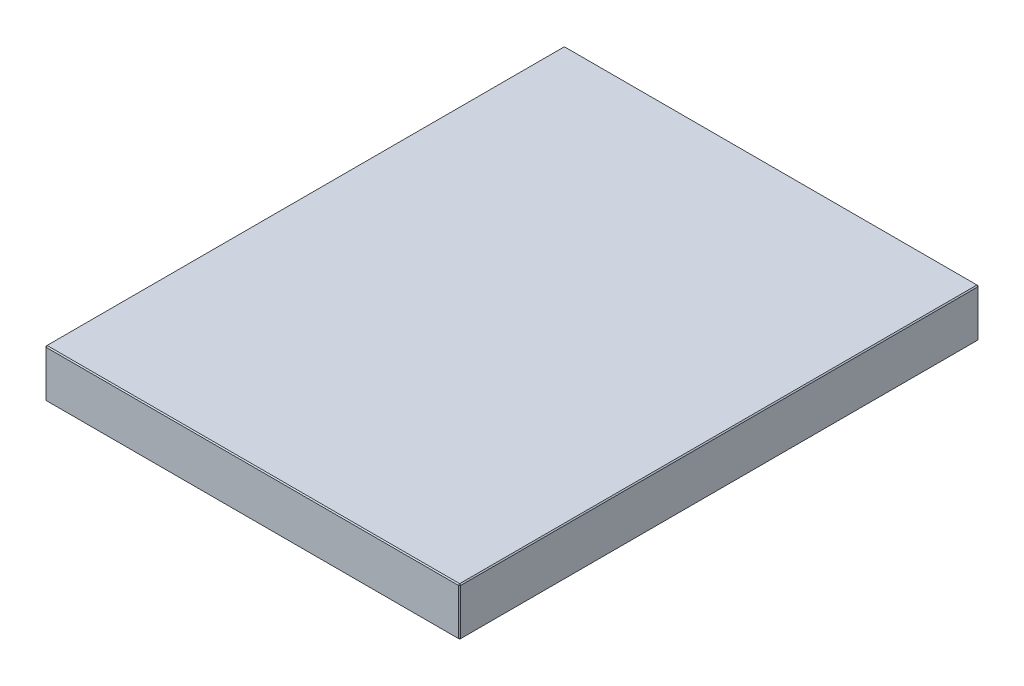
ISO-10303-21;
HEADER;
FILE_DESCRIPTION(('STEP AP214'),'2;1');
FILE_NAME('part.step','',(''),(''),'','','');
FILE_SCHEMA(('AUTOMOTIVE_DESIGN { 1 0 10303 214 1 1 1 1 }'));
ENDSEC;
DATA;
#1=APPLICATION_CONTEXT('core data for automotive mechanical design processes');
#2=APPLICATION_PROTOCOL_DEFINITION('international standard','automotive_design',2000,#1);
#3=PRODUCT_CONTEXT('',#1,'mechanical');
#4=PRODUCT('Part','Part','',(#3));
#5=PRODUCT_RELATED_PRODUCT_CATEGORY('part','',(#4));
#6=PRODUCT_DEFINITION_FORMATION('','',#4);
#7=PRODUCT_DEFINITION_CONTEXT('part definition',#1,'design');
#8=PRODUCT_DEFINITION('design','',#6,#7);
#9=PRODUCT_DEFINITION_SHAPE('','',#8);
#10=(LENGTH_UNIT() NAMED_UNIT(*) SI_UNIT(.MILLI.,.METRE.));
#11=(NAMED_UNIT(*) PLANE_ANGLE_UNIT() SI_UNIT($,.RADIAN.));
#12=(NAMED_UNIT(*) SI_UNIT($,.STERADIAN.) SOLID_ANGLE_UNIT());
#13=UNCERTAINTY_MEASURE_WITH_UNIT(LENGTH_MEASURE(1.E-05),#10,'distance_accuracy_value','');
#14=(GEOMETRIC_REPRESENTATION_CONTEXT(3) GLOBAL_UNCERTAINTY_ASSIGNED_CONTEXT((#13)) GLOBAL_UNIT_ASSIGNED_CONTEXT((#10,
#11,#12)) REPRESENTATION_CONTEXT('',''));
#15=CARTESIAN_POINT('',(0.,0.,0.));
#16=DIRECTION('',(0.,0.,1.));
#17=DIRECTION('',(1.,0.,0.));
#18=AXIS2_PLACEMENT_3D('',#15,#16,#17);
#19=CARTESIAN_POINT('',(-198.,46.,248.));
#20=DIRECTION('',(1.,0.,0.));
#21=DIRECTION('',(0.,0.,-1.));
#22=AXIS2_PLACEMENT_3D('',#19,#20,#21);
#23=PLANE('',#22);
#24=DIRECTION('',(0.,-1.,0.));
#25=VECTOR('',#24,1.);
#26=CARTESIAN_POINT('',(-198.,46.,-247.));
#27=LINE('',#26,#25);
#28=CARTESIAN_POINT('',(-198.,45.,-247.));
#29=VERTEX_POINT('',#28);
#30=CARTESIAN_POINT('',(-198.,1.,-247.));
#31=VERTEX_POINT('',#30);
#32=EDGE_CURVE('E114',#29,#31,#27,.T.);
#33=ORIENTED_EDGE('',*,*,#32,.T.);
#34=DIRECTION('',(0.,0.,1.));
#35=VECTOR('',#34,1.);
#36=CARTESIAN_POINT('',(-198.,1.,248.));
#37=LINE('',#36,#35);
#38=CARTESIAN_POINT('',(-198.,1.,247.));
#39=VERTEX_POINT('',#38);
#40=EDGE_CURVE('E110',#31,#39,#37,.T.);
#41=ORIENTED_EDGE('',*,*,#40,.T.);
#42=DIRECTION('',(0.,1.,0.));
#43=VECTOR('',#42,1.);
#44=CARTESIAN_POINT('',(-198.,46.,247.));
#45=LINE('',#44,#43);
#46=CARTESIAN_POINT('',(-198.,45.,247.));
#47=VERTEX_POINT('',#46);
#48=EDGE_CURVE('E103',#39,#47,#45,.T.);
#49=ORIENTED_EDGE('',*,*,#48,.T.);
#50=DIRECTION('',(0.,0.,-1.));
#51=VECTOR('',#50,1.);
#52=CARTESIAN_POINT('',(-198.,45.,-248.));
#53=LINE('',#52,#51);
#54=EDGE_CURVE('E107',#47,#29,#53,.T.);
#55=ORIENTED_EDGE('',*,*,#54,.T.);
#56=EDGE_LOOP('',(#33,#41,#49,#55));
#57=FACE_BOUND('',#56,.T.);
#58=ADVANCED_FACE('F15',(#57),#23,.F.);
#59=CARTESIAN_POINT('',(198.,46.,248.));
#60=DIRECTION('',(0.,0.,-1.));
#61=DIRECTION('',(-1.,0.,0.));
#62=AXIS2_PLACEMENT_3D('',#59,#60,#61);
#63=PLANE('',#62);
#64=DIRECTION('',(-1.,0.,0.));
#65=VECTOR('',#64,1.);
#66=CARTESIAN_POINT('',(-198.,45.,248.));
#67=LINE('',#66,#65);
#68=CARTESIAN_POINT('',(197.,45.,248.));
#69=VERTEX_POINT('',#68);
#70=CARTESIAN_POINT('',(-197.,45.,248.));
#71=VERTEX_POINT('',#70);
#72=EDGE_CURVE('E164',#69,#71,#67,.T.);
#73=ORIENTED_EDGE('',*,*,#72,.T.);
#74=DIRECTION('',(0.,-1.,0.));
#75=VECTOR('',#74,1.);
#76=CARTESIAN_POINT('',(-197.,46.,248.));
#77=LINE('',#76,#75);
#78=CARTESIAN_POINT('',(-197.,1.,248.));
#79=VERTEX_POINT('',#78);
#80=EDGE_CURVE('E122',#71,#79,#77,.T.);
#81=ORIENTED_EDGE('',*,*,#80,.T.);
#82=DIRECTION('',(1.,0.,0.));
#83=VECTOR('',#82,1.);
#84=CARTESIAN_POINT('',(198.,1.,248.));
#85=LINE('',#84,#83);
#86=CARTESIAN_POINT('',(197.,1.,248.));
#87=VERTEX_POINT('',#86);
#88=EDGE_CURVE('E168',#79,#87,#85,.T.);
#89=ORIENTED_EDGE('',*,*,#88,.T.);
#90=DIRECTION('',(0.,1.,0.));
#91=VECTOR('',#90,1.);
#92=CARTESIAN_POINT('',(197.,46.,248.));
#93=LINE('',#92,#91);
#94=EDGE_CURVE('E166',#87,#69,#93,.T.);
#95=ORIENTED_EDGE('',*,*,#94,.T.);
#96=EDGE_LOOP('',(#73,#81,#89,#95));
#97=FACE_BOUND('',#96,.T.);
#98=ADVANCED_FACE('F275',(#97),#63,.F.);
#99=CARTESIAN_POINT('',(198.,46.,248.));
#100=DIRECTION('',(-1.,0.,0.));
#101=DIRECTION('',(0.,0.,1.));
#102=AXIS2_PLACEMENT_3D('',#99,#100,#101);
#103=PLANE('',#102);
#104=DIRECTION('',(0.,0.,-1.));
#105=VECTOR('',#104,1.);
#106=CARTESIAN_POINT('',(198.,1.,248.));
#107=LINE('',#106,#105);
#108=CARTESIAN_POINT('',(198.,1.,247.));
#109=VERTEX_POINT('',#108);
#110=CARTESIAN_POINT('',(198.,1.,-247.));
#111=VERTEX_POINT('',#110);
#112=EDGE_CURVE('E159',#109,#111,#107,.T.);
#113=ORIENTED_EDGE('',*,*,#112,.T.);
#114=DIRECTION('',(0.,1.,0.));
#115=VECTOR('',#114,1.);
#116=CARTESIAN_POINT('',(198.,46.,-247.));
#117=LINE('',#116,#115);
#118=CARTESIAN_POINT('',(198.,45.,-247.));
#119=VERTEX_POINT('',#118);
#120=EDGE_CURVE('E161',#111,#119,#117,.T.);
#121=ORIENTED_EDGE('',*,*,#120,.T.);
#122=DIRECTION('',(0.,0.,1.));
#123=VECTOR('',#122,1.);
#124=CARTESIAN_POINT('',(198.,45.,248.));
#125=LINE('',#124,#123);
#126=CARTESIAN_POINT('',(198.,45.,247.));
#127=VERTEX_POINT('',#126);
#128=EDGE_CURVE('E155',#119,#127,#125,.T.);
#129=ORIENTED_EDGE('',*,*,#128,.T.);
#130=DIRECTION('',(0.,-1.,0.));
#131=VECTOR('',#130,1.);
#132=CARTESIAN_POINT('',(198.,46.,247.));
#133=LINE('',#132,#131);
#134=EDGE_CURVE('E157',#127,#109,#133,.T.);
#135=ORIENTED_EDGE('',*,*,#134,.T.);
#136=EDGE_LOOP('',(#113,#121,#129,#135));
#137=FACE_BOUND('',#136,.T.);
#138=ADVANCED_FACE('F254',(#137),#103,.F.);
#139=CARTESIAN_POINT('',(198.,46.,-248.));
#140=DIRECTION('',(0.,0.,1.));
#141=DIRECTION('',(1.,0.,0.));
#142=AXIS2_PLACEMENT_3D('',#139,#140,#141);
#143=PLANE('',#142);
#144=DIRECTION('',(0.,-1.,0.));
#145=VECTOR('',#144,1.);
#146=CARTESIAN_POINT('',(197.,46.,-248.));
#147=LINE('',#146,#145);
#148=CARTESIAN_POINT('',(197.,45.,-248.));
#149=VERTEX_POINT('',#148);
#150=CARTESIAN_POINT('',(197.,1.,-248.));
#151=VERTEX_POINT('',#150);
#152=EDGE_CURVE('E148',#149,#151,#147,.T.);
#153=ORIENTED_EDGE('',*,*,#152,.T.);
#154=DIRECTION('',(-1.,0.,0.));
#155=VECTOR('',#154,1.);
#156=CARTESIAN_POINT('',(198.,1.,-248.));
#157=LINE('',#156,#155);
#158=CARTESIAN_POINT('',(-197.,1.,-248.));
#159=VERTEX_POINT('',#158);
#160=EDGE_CURVE('E153',#151,#159,#157,.T.);
#161=ORIENTED_EDGE('',*,*,#160,.T.);
#162=DIRECTION('',(0.,1.,0.));
#163=VECTOR('',#162,1.);
#164=CARTESIAN_POINT('',(-197.,46.,-248.));
#165=LINE('',#164,#163);
#166=CARTESIAN_POINT('',(-197.,45.,-248.));
#167=VERTEX_POINT('',#166);
#168=EDGE_CURVE('E150',#159,#167,#165,.T.);
#169=ORIENTED_EDGE('',*,*,#168,.T.);
#170=DIRECTION('',(1.,0.,0.));
#171=VECTOR('',#170,1.);
#172=CARTESIAN_POINT('',(198.,45.,-248.));
#173=LINE('',#172,#171);
#174=EDGE_CURVE('E146',#167,#149,#173,.T.);
#175=ORIENTED_EDGE('',*,*,#174,.T.);
#176=EDGE_LOOP('',(#153,#161,#169,#175));
#177=FACE_BOUND('',#176,.T.);
#178=ADVANCED_FACE('F284',(#177),#143,.F.);
#179=CARTESIAN_POINT('',(0.,46.,0.));
#180=DIRECTION('',(0.,1.,0.));
#181=DIRECTION('',(0.,0.,1.));
#182=AXIS2_PLACEMENT_3D('',#179,#180,#181);
#183=PLANE('',#182);
#184=DIRECTION('',(0.,0.,-1.));
#185=VECTOR('',#184,1.);
#186=CARTESIAN_POINT('',(197.,46.,-248.));
#187=LINE('',#186,#185);
#188=CARTESIAN_POINT('',(197.,46.,247.));
#189=VERTEX_POINT('',#188);
#190=CARTESIAN_POINT('',(197.,46.,-247.));
#191=VERTEX_POINT('',#190);
#192=EDGE_CURVE('E24',#189,#191,#187,.T.);
#193=ORIENTED_EDGE('',*,*,#192,.T.);
#194=DIRECTION('',(-1.,0.,0.));
#195=VECTOR('',#194,1.);
#196=CARTESIAN_POINT('',(-198.,46.,-247.));
#197=LINE('',#196,#195);
#198=CARTESIAN_POINT('',(-197.,46.,-247.));
#199=VERTEX_POINT('',#198);
#200=EDGE_CURVE('E9',#191,#199,#197,.T.);
#201=ORIENTED_EDGE('',*,*,#200,.T.);
#202=DIRECTION('',(0.,0.,1.));
#203=VECTOR('',#202,1.);
#204=CARTESIAN_POINT('',(-197.,46.,248.));
#205=LINE('',#204,#203);
#206=CARTESIAN_POINT('',(-197.,46.,247.));
#207=VERTEX_POINT('',#206);
#208=EDGE_CURVE('E180',#199,#207,#205,.T.);
#209=ORIENTED_EDGE('',*,*,#208,.T.);
#210=DIRECTION('',(1.,0.,0.));
#211=VECTOR('',#210,1.);
#212=CARTESIAN_POINT('',(198.,46.,247.));
#213=LINE('',#212,#211);
#214=EDGE_CURVE('E35',#207,#189,#213,.T.);
#215=ORIENTED_EDGE('',*,*,#214,.T.);
#216=EDGE_LOOP('',(#193,#201,#209,#215));
#217=FACE_BOUND('',#216,.T.);
#218=ADVANCED_FACE('F350',(#217),#183,.T.);
#219=CARTESIAN_POINT('',(0.,0.,0.));
#220=DIRECTION('',(0.,1.,0.));
#221=DIRECTION('',(0.,0.,1.));
#222=AXIS2_PLACEMENT_3D('',#219,#220,#221);
#223=PLANE('',#222);
#224=DIRECTION('',(0.,0.,1.));
#225=VECTOR('',#224,1.);
#226=CARTESIAN_POINT('',(197.,0.,0.));
#227=LINE('',#226,#225);
#228=CARTESIAN_POINT('',(197.,0.,-247.));
#229=VERTEX_POINT('',#228);
#230=CARTESIAN_POINT('',(197.,0.,247.));
#231=VERTEX_POINT('',#230);
#232=EDGE_CURVE('E171',#229,#231,#227,.T.);
#233=ORIENTED_EDGE('',*,*,#232,.T.);
#234=DIRECTION('',(-1.,0.,0.));
#235=VECTOR('',#234,1.);
#236=CARTESIAN_POINT('',(0.,0.,247.));
#237=LINE('',#236,#235);
#238=CARTESIAN_POINT('',(-197.,0.,247.));
#239=VERTEX_POINT('',#238);
#240=EDGE_CURVE('E177',#231,#239,#237,.T.);
#241=ORIENTED_EDGE('',*,*,#240,.T.);
#242=DIRECTION('',(0.,0.,-1.));
#243=VECTOR('',#242,1.);
#244=CARTESIAN_POINT('',(-197.,0.,0.));
#245=LINE('',#244,#243);
#246=CARTESIAN_POINT('',(-197.,0.,-247.));
#247=VERTEX_POINT('',#246);
#248=EDGE_CURVE('E175',#239,#247,#245,.T.);
#249=ORIENTED_EDGE('',*,*,#248,.T.);
#250=DIRECTION('',(1.,0.,0.));
#251=VECTOR('',#250,1.);
#252=CARTESIAN_POINT('',(0.,0.,-247.));
#253=LINE('',#252,#251);
#254=EDGE_CURVE('E173',#247,#229,#253,.T.);
#255=ORIENTED_EDGE('',*,*,#254,.T.);
#256=EDGE_LOOP('',(#233,#241,#249,#255));
#257=FACE_BOUND('',#256,.T.);
#258=ADVANCED_FACE('F246',(#257),#223,.F.);
#259=CARTESIAN_POINT('',(198.,46.,247.));
#260=DIRECTION('',(-0.707106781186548,0.,-0.707106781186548));
#261=DIRECTION('',(0.,-1.,0.));
#262=AXIS2_PLACEMENT_3D('',#259,#260,#261);
#263=PLANE('',#262);
#264=DIRECTION('',(-0.707106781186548,0.,0.707106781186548));
#265=VECTOR('',#264,1.);
#266=CARTESIAN_POINT('',(197.,45.,248.));
#267=LINE('',#266,#265);
#268=EDGE_CURVE('E19',#69,#127,#267,.F.);
#269=ORIENTED_EDGE('',*,*,#268,.F.);
#270=ORIENTED_EDGE('',*,*,#94,.F.);
#271=DIRECTION('',(0.707106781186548,0.,-0.707106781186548));
#272=VECTOR('',#271,1.);
#273=CARTESIAN_POINT('',(197.,1.,248.));
#274=LINE('',#273,#272);
#275=EDGE_CURVE('E142',#109,#87,#274,.F.);
#276=ORIENTED_EDGE('',*,*,#275,.F.);
#277=ORIENTED_EDGE('',*,*,#134,.F.);
#278=EDGE_LOOP('',(#269,#270,#276,#277));
#279=FACE_BOUND('',#278,.T.);
#280=ADVANCED_FACE('F17',(#279),#263,.F.);
#281=CARTESIAN_POINT('',(197.,45.,248.));
#282=DIRECTION('',(0.577350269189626,0.577350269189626,0.577350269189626));
#283=DIRECTION('',(0.707106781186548,0.,-0.707106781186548));
#284=AXIS2_PLACEMENT_3D('',#281,#282,#283);
#285=PLANE('',#284);
#286=DIRECTION('',(0.,-0.707106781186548,0.707106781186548));
#287=VECTOR('',#286,1.);
#288=CARTESIAN_POINT('',(197.,45.,248.));
#289=LINE('',#288,#287);
#290=EDGE_CURVE('E226',#69,#189,#289,.F.);
#291=ORIENTED_EDGE('',*,*,#290,.F.);
#292=ORIENTED_EDGE('',*,*,#268,.T.);
#293=DIRECTION('',(-0.707106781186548,0.707106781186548,0.));
#294=VECTOR('',#293,1.);
#295=CARTESIAN_POINT('',(197.5,45.5,247.));
#296=LINE('',#295,#294);
#297=EDGE_CURVE('E228',#189,#127,#296,.F.);
#298=ORIENTED_EDGE('',*,*,#297,.F.);
#299=EDGE_LOOP('',(#291,#292,#298));
#300=FACE_BOUND('',#299,.T.);
#301=ADVANCED_FACE('F270',(#300),#285,.T.);
#302=CARTESIAN_POINT('',(197.,1.,248.));
#303=DIRECTION('',(0.577350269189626,-0.577350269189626,0.577350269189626));
#304=DIRECTION('',(0.707106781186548,0.,-0.707106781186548));
#305=AXIS2_PLACEMENT_3D('',#302,#303,#304);
#306=PLANE('',#305);
#307=DIRECTION('',(-0.707106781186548,-0.707106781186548,0.));
#308=VECTOR('',#307,1.);
#309=CARTESIAN_POINT('',(197.5,0.5,247.));
#310=LINE('',#309,#308);
#311=EDGE_CURVE('E220',#109,#231,#310,.T.);
#312=ORIENTED_EDGE('',*,*,#311,.F.);
#313=ORIENTED_EDGE('',*,*,#275,.T.);
#314=DIRECTION('',(0.,0.707106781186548,0.707106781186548));
#315=VECTOR('',#314,1.);
#316=CARTESIAN_POINT('',(197.,1.,248.));
#317=LINE('',#316,#315);
#318=EDGE_CURVE('E223',#231,#87,#317,.T.);
#319=ORIENTED_EDGE('',*,*,#318,.F.);
#320=EDGE_LOOP('',(#312,#313,#319));
#321=FACE_BOUND('',#320,.T.);
#322=ADVANCED_FACE('F235',(#321),#306,.T.);
#323=CARTESIAN_POINT('',(197.,46.,0.));
#324=DIRECTION('',(0.707106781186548,0.707106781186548,0.));
#325=DIRECTION('',(0.,0.,1.));
#326=AXIS2_PLACEMENT_3D('',#323,#324,#325);
#327=PLANE('',#326);
#328=ORIENTED_EDGE('',*,*,#297,.T.);
#329=ORIENTED_EDGE('',*,*,#128,.F.);
#330=DIRECTION('',(0.707106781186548,-0.707106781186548,0.));
#331=VECTOR('',#330,1.);
#332=CARTESIAN_POINT('',(198.,45.,-247.));
#333=LINE('',#332,#331);
#334=EDGE_CURVE('E215',#191,#119,#333,.T.);
#335=ORIENTED_EDGE('',*,*,#334,.F.);
#336=ORIENTED_EDGE('',*,*,#192,.F.);
#337=EDGE_LOOP('',(#328,#329,#335,#336));
#338=FACE_BOUND('',#337,.T.);
#339=ADVANCED_FACE('F265',(#338),#327,.T.);
#340=CARTESIAN_POINT('',(0.,46.,247.));
#341=DIRECTION('',(0.,0.707106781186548,0.707106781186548));
#342=DIRECTION('',(-1.,0.,0.));
#343=AXIS2_PLACEMENT_3D('',#340,#341,#342);
#344=PLANE('',#343);
#345=ORIENTED_EDGE('',*,*,#290,.T.);
#346=ORIENTED_EDGE('',*,*,#214,.F.);
#347=DIRECTION('',(0.,0.707106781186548,-0.707106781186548));
#348=VECTOR('',#347,1.);
#349=CARTESIAN_POINT('',(-197.,45.5,247.5));
#350=LINE('',#349,#348);
#351=EDGE_CURVE('E126',#71,#207,#350,.T.);
#352=ORIENTED_EDGE('',*,*,#351,.F.);
#353=ORIENTED_EDGE('',*,*,#72,.F.);
#354=EDGE_LOOP('',(#345,#346,#352,#353));
#355=FACE_BOUND('',#354,.T.);
#356=ADVANCED_FACE('F273',(#355),#344,.T.);
#357=CARTESIAN_POINT('',(-197.,46.,248.));
#358=DIRECTION('',(0.707106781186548,0.,-0.707106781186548));
#359=DIRECTION('',(0.,-1.,0.));
#360=AXIS2_PLACEMENT_3D('',#357,#358,#359);
#361=PLANE('',#360);
#362=DIRECTION('',(0.707106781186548,0.,0.707106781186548));
#363=VECTOR('',#362,1.);
#364=CARTESIAN_POINT('',(-197.,1.,248.));
#365=LINE('',#364,#363);
#366=EDGE_CURVE('E127',#79,#39,#365,.F.);
#367=ORIENTED_EDGE('',*,*,#366,.F.);
#368=ORIENTED_EDGE('',*,*,#80,.F.);
#369=DIRECTION('',(-0.707106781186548,0.,-0.707106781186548));
#370=VECTOR('',#369,1.);
#371=CARTESIAN_POINT('',(-198.,45.,247.));
#372=LINE('',#371,#370);
#373=EDGE_CURVE('E118',#47,#71,#372,.F.);
#374=ORIENTED_EDGE('',*,*,#373,.F.);
#375=ORIENTED_EDGE('',*,*,#48,.F.);
#376=EDGE_LOOP('',(#367,#368,#374,#375));
#377=FACE_BOUND('',#376,.T.);
#378=ADVANCED_FACE('F120',(#377),#361,.F.);
#379=CARTESIAN_POINT('',(198.,1.,248.));
#380=DIRECTION('',(0.,0.707106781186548,-0.707106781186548));
#381=DIRECTION('',(1.,0.,0.));
#382=AXIS2_PLACEMENT_3D('',#379,#380,#381);
#383=PLANE('',#382);
#384=ORIENTED_EDGE('',*,*,#318,.T.);
#385=ORIENTED_EDGE('',*,*,#88,.F.);
#386=DIRECTION('',(0.,-0.707106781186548,-0.707106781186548));
#387=VECTOR('',#386,1.);
#388=CARTESIAN_POINT('',(-197.,1.,248.));
#389=LINE('',#388,#387);
#390=EDGE_CURVE('E211',#239,#79,#389,.F.);
#391=ORIENTED_EDGE('',*,*,#390,.F.);
#392=ORIENTED_EDGE('',*,*,#240,.F.);
#393=EDGE_LOOP('',(#384,#385,#391,#392));
#394=FACE_BOUND('',#393,.T.);
#395=ADVANCED_FACE('F243',(#394),#383,.F.);
#396=CARTESIAN_POINT('',(198.,1.,248.));
#397=DIRECTION('',(-0.707106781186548,0.707106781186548,0.));
#398=DIRECTION('',(0.,0.,-1.));
#399=AXIS2_PLACEMENT_3D('',#396,#397,#398);
#400=PLANE('',#399);
#401=ORIENTED_EDGE('',*,*,#311,.T.);
#402=ORIENTED_EDGE('',*,*,#232,.F.);
#403=DIRECTION('',(0.707106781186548,0.707106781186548,0.));
#404=VECTOR('',#403,1.);
#405=CARTESIAN_POINT('',(197.5,0.500000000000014,-247.));
#406=LINE('',#405,#404);
#407=EDGE_CURVE('E208',#111,#229,#406,.F.);
#408=ORIENTED_EDGE('',*,*,#407,.F.);
#409=ORIENTED_EDGE('',*,*,#112,.F.);
#410=EDGE_LOOP('',(#401,#402,#408,#409));
#411=FACE_BOUND('',#410,.T.);
#412=ADVANCED_FACE('F251',(#411),#400,.F.);
#413=CARTESIAN_POINT('',(197.,46.,-248.));
#414=DIRECTION('',(-0.707106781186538,0.,0.707106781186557));
#415=DIRECTION('',(0.,-1.,0.));
#416=AXIS2_PLACEMENT_3D('',#413,#414,#415);
#417=PLANE('',#416);
#418=DIRECTION('',(0.707106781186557,0.,0.707106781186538));
#419=VECTOR('',#418,1.);
#420=CARTESIAN_POINT('',(198.,45.,-247.));
#421=LINE('',#420,#419);
#422=EDGE_CURVE('E217',#119,#149,#421,.F.);
#423=ORIENTED_EDGE('',*,*,#422,.F.);
#424=ORIENTED_EDGE('',*,*,#120,.F.);
#425=DIRECTION('',(-0.707106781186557,0.,-0.707106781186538));
#426=VECTOR('',#425,1.);
#427=CARTESIAN_POINT('',(197.,1.,-248.));
#428=LINE('',#427,#426);
#429=EDGE_CURVE('E205',#151,#111,#428,.F.);
#430=ORIENTED_EDGE('',*,*,#429,.F.);
#431=ORIENTED_EDGE('',*,*,#152,.F.);
#432=EDGE_LOOP('',(#423,#424,#430,#431));
#433=FACE_BOUND('',#432,.T.);
#434=ADVANCED_FACE('F258',(#433),#417,.F.);
#435=CARTESIAN_POINT('',(198.,45.,-247.));
#436=DIRECTION('',(0.577350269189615,0.577350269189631,-0.577350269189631));
#437=DIRECTION('',(0.,0.707106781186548,0.707106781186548));
#438=AXIS2_PLACEMENT_3D('',#435,#436,#437);
#439=PLANE('',#438);
#440=ORIENTED_EDGE('',*,*,#334,.T.);
#441=ORIENTED_EDGE('',*,*,#422,.T.);
#442=DIRECTION('',(0.,0.707106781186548,0.707106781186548));
#443=VECTOR('',#442,1.);
#444=CARTESIAN_POINT('',(197.,45.5,-247.5));
#445=LINE('',#444,#443);
#446=EDGE_CURVE('E134',#191,#149,#445,.F.);
#447=ORIENTED_EDGE('',*,*,#446,.F.);
#448=EDGE_LOOP('',(#440,#441,#447));
#449=FACE_BOUND('',#448,.T.);
#450=ADVANCED_FACE('F325',(#449),#439,.T.);
#451=CARTESIAN_POINT('',(-198.,45.,247.));
#452=DIRECTION('',(-0.577350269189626,0.577350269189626,0.577350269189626));
#453=DIRECTION('',(0.707106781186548,0.,0.707106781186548));
#454=AXIS2_PLACEMENT_3D('',#451,#452,#453);
#455=PLANE('',#454);
#456=ORIENTED_EDGE('',*,*,#373,.T.);
#457=ORIENTED_EDGE('',*,*,#351,.T.);
#458=DIRECTION('',(-0.707106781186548,-0.707106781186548,0.));
#459=VECTOR('',#458,1.);
#460=CARTESIAN_POINT('',(-198.,45.,247.));
#461=LINE('',#460,#459);
#462=EDGE_CURVE('E130',#47,#207,#461,.F.);
#463=ORIENTED_EDGE('',*,*,#462,.F.);
#464=EDGE_LOOP('',(#456,#457,#463));
#465=FACE_BOUND('',#464,.T.);
#466=ADVANCED_FACE('F131',(#465),#455,.T.);
#467=CARTESIAN_POINT('',(-197.,1.,248.));
#468=DIRECTION('',(-0.577350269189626,-0.577350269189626,0.577350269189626));
#469=DIRECTION('',(0.707106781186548,0.,0.707106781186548));
#470=AXIS2_PLACEMENT_3D('',#467,#468,#469);
#471=PLANE('',#470);
#472=ORIENTED_EDGE('',*,*,#390,.T.);
#473=ORIENTED_EDGE('',*,*,#366,.T.);
#474=DIRECTION('',(-0.707106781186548,0.707106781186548,0.));
#475=VECTOR('',#474,1.);
#476=CARTESIAN_POINT('',(-197.5,0.5,247.));
#477=LINE('',#476,#475);
#478=EDGE_CURVE('E135',#239,#39,#477,.T.);
#479=ORIENTED_EDGE('',*,*,#478,.F.);
#480=EDGE_LOOP('',(#472,#473,#479));
#481=FACE_BOUND('',#480,.T.);
#482=ADVANCED_FACE('F318',(#481),#471,.T.);
#483=CARTESIAN_POINT('',(197.,1.,-248.));
#484=DIRECTION('',(0.577350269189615,-0.577350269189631,-0.577350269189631));
#485=DIRECTION('',(0.,0.707106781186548,-0.707106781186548));
#486=AXIS2_PLACEMENT_3D('',#483,#484,#485);
#487=PLANE('',#486);
#488=ORIENTED_EDGE('',*,*,#429,.T.);
#489=ORIENTED_EDGE('',*,*,#407,.T.);
#490=DIRECTION('',(0.,-0.707106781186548,0.707106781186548));
#491=VECTOR('',#490,1.);
#492=CARTESIAN_POINT('',(197.,1.,-248.));
#493=LINE('',#492,#491);
#494=EDGE_CURVE('E198',#151,#229,#493,.T.);
#495=ORIENTED_EDGE('',*,*,#494,.F.);
#496=EDGE_LOOP('',(#488,#489,#495));
#497=FACE_BOUND('',#496,.T.);
#498=ADVANCED_FACE('F314',(#497),#487,.T.);
#499=CARTESIAN_POINT('',(0.,46.,-247.));
#500=DIRECTION('',(0.,0.707106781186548,-0.707106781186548));
#501=DIRECTION('',(1.,0.,0.));
#502=AXIS2_PLACEMENT_3D('',#499,#500,#501);
#503=PLANE('',#502);
#504=ORIENTED_EDGE('',*,*,#446,.T.);
#505=ORIENTED_EDGE('',*,*,#174,.F.);
#506=DIRECTION('',(0.,-0.707106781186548,-0.707106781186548));
#507=VECTOR('',#506,1.);
#508=CARTESIAN_POINT('',(-197.,45.,-248.));
#509=LINE('',#508,#507);
#510=EDGE_CURVE('E195',#199,#167,#509,.T.);
#511=ORIENTED_EDGE('',*,*,#510,.F.);
#512=ORIENTED_EDGE('',*,*,#200,.F.);
#513=EDGE_LOOP('',(#504,#505,#511,#512));
#514=FACE_BOUND('',#513,.T.);
#515=ADVANCED_FACE('F311',(#514),#503,.T.);
#516=CARTESIAN_POINT('',(-197.,46.,0.));
#517=DIRECTION('',(-0.707106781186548,0.707106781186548,0.));
#518=DIRECTION('',(0.,0.,-1.));
#519=AXIS2_PLACEMENT_3D('',#516,#517,#518);
#520=PLANE('',#519);
#521=ORIENTED_EDGE('',*,*,#462,.T.);
#522=ORIENTED_EDGE('',*,*,#208,.F.);
#523=DIRECTION('',(0.707106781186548,0.707106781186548,0.));
#524=VECTOR('',#523,1.);
#525=CARTESIAN_POINT('',(-197.5,45.5,-247.));
#526=LINE('',#525,#524);
#527=EDGE_CURVE('E138',#29,#199,#526,.T.);
#528=ORIENTED_EDGE('',*,*,#527,.F.);
#529=ORIENTED_EDGE('',*,*,#54,.F.);
#530=EDGE_LOOP('',(#521,#522,#528,#529));
#531=FACE_BOUND('',#530,.T.);
#532=ADVANCED_FACE('F137',(#531),#520,.T.);
#533=CARTESIAN_POINT('',(-198.,1.,248.));
#534=DIRECTION('',(0.707106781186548,0.707106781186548,0.));
#535=DIRECTION('',(0.,0.,1.));
#536=AXIS2_PLACEMENT_3D('',#533,#534,#535);
#537=PLANE('',#536);
#538=ORIENTED_EDGE('',*,*,#478,.T.);
#539=ORIENTED_EDGE('',*,*,#40,.F.);
#540=DIRECTION('',(0.707106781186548,-0.707106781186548,0.));
#541=VECTOR('',#540,1.);
#542=CARTESIAN_POINT('',(-198.,1.,-247.));
#543=LINE('',#542,#541);
#544=EDGE_CURVE('E191',#247,#31,#543,.F.);
#545=ORIENTED_EDGE('',*,*,#544,.F.);
#546=ORIENTED_EDGE('',*,*,#248,.F.);
#547=EDGE_LOOP('',(#538,#539,#545,#546));
#548=FACE_BOUND('',#547,.T.);
#549=ADVANCED_FACE('F304',(#548),#537,.F.);
#550=CARTESIAN_POINT('',(198.,1.,-248.));
#551=DIRECTION('',(0.,0.707106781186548,0.707106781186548));
#552=DIRECTION('',(-1.,0.,0.));
#553=AXIS2_PLACEMENT_3D('',#550,#551,#552);
#554=PLANE('',#553);
#555=ORIENTED_EDGE('',*,*,#494,.T.);
#556=ORIENTED_EDGE('',*,*,#254,.F.);
#557=DIRECTION('',(0.,0.707106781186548,-0.707106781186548));
#558=VECTOR('',#557,1.);
#559=CARTESIAN_POINT('',(-197.,0.499999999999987,-247.5));
#560=LINE('',#559,#558);
#561=EDGE_CURVE('E188',#159,#247,#560,.F.);
#562=ORIENTED_EDGE('',*,*,#561,.F.);
#563=ORIENTED_EDGE('',*,*,#160,.F.);
#564=EDGE_LOOP('',(#555,#556,#562,#563));
#565=FACE_BOUND('',#564,.T.);
#566=ADVANCED_FACE('F300',(#565),#554,.F.);
#567=CARTESIAN_POINT('',(-197.,45.,-248.));
#568=DIRECTION('',(-0.577350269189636,0.57735026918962,-0.57735026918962));
#569=DIRECTION('',(-0.707106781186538,0.,0.707106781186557));
#570=AXIS2_PLACEMENT_3D('',#567,#568,#569);
#571=PLANE('',#570);
#572=ORIENTED_EDGE('',*,*,#527,.T.);
#573=ORIENTED_EDGE('',*,*,#510,.T.);
#574=DIRECTION('',(0.707106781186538,0.,-0.707106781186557));
#575=VECTOR('',#574,1.);
#576=CARTESIAN_POINT('',(-197.,45.,-248.));
#577=LINE('',#576,#575);
#578=EDGE_CURVE('E186',#29,#167,#577,.T.);
#579=ORIENTED_EDGE('',*,*,#578,.F.);
#580=EDGE_LOOP('',(#572,#573,#579));
#581=FACE_BOUND('',#580,.T.);
#582=ADVANCED_FACE('F296',(#581),#571,.T.);
#583=CARTESIAN_POINT('',(-198.,1.,-247.));
#584=DIRECTION('',(-0.577350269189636,-0.57735026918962,-0.57735026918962));
#585=DIRECTION('',(-0.707106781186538,0.,0.707106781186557));
#586=AXIS2_PLACEMENT_3D('',#583,#584,#585);
#587=PLANE('',#586);
#588=ORIENTED_EDGE('',*,*,#561,.T.);
#589=ORIENTED_EDGE('',*,*,#544,.T.);
#590=DIRECTION('',(-0.707106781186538,0.,0.707106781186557));
#591=VECTOR('',#590,1.);
#592=CARTESIAN_POINT('',(-198.,1.,-247.));
#593=LINE('',#592,#591);
#594=EDGE_CURVE('E184',#159,#31,#593,.T.);
#595=ORIENTED_EDGE('',*,*,#594,.F.);
#596=EDGE_LOOP('',(#588,#589,#595));
#597=FACE_BOUND('',#596,.T.);
#598=ADVANCED_FACE('F292',(#597),#587,.T.);
#599=CARTESIAN_POINT('',(-198.,46.,-247.));
#600=DIRECTION('',(0.707106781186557,0.,0.707106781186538));
#601=DIRECTION('',(0.,-1.,0.));
#602=AXIS2_PLACEMENT_3D('',#599,#600,#601);
#603=PLANE('',#602);
#604=ORIENTED_EDGE('',*,*,#578,.T.);
#605=ORIENTED_EDGE('',*,*,#168,.F.);
#606=ORIENTED_EDGE('',*,*,#594,.T.);
#607=ORIENTED_EDGE('',*,*,#32,.F.);
#608=EDGE_LOOP('',(#604,#605,#606,#607));
#609=FACE_BOUND('',#608,.T.);
#610=ADVANCED_FACE('F289',(#609),#603,.F.);
#611=CLOSED_SHELL('',(#58,#98,#138,#178,#218,#258,#280,#301,#322,#339,#356,#378,#395,#412,#434,
#450,#466,#482,#498,#515,#532,#549,#566,#582,#598,#610));
#612=MANIFOLD_SOLID_BREP('B1',#611);
#613=ADVANCED_BREP_SHAPE_REPRESENTATION('',(#18,#612),#14);
#614=SHAPE_DEFINITION_REPRESENTATION(#9,#613);
ENDSEC;
END-ISO-10303-21;
